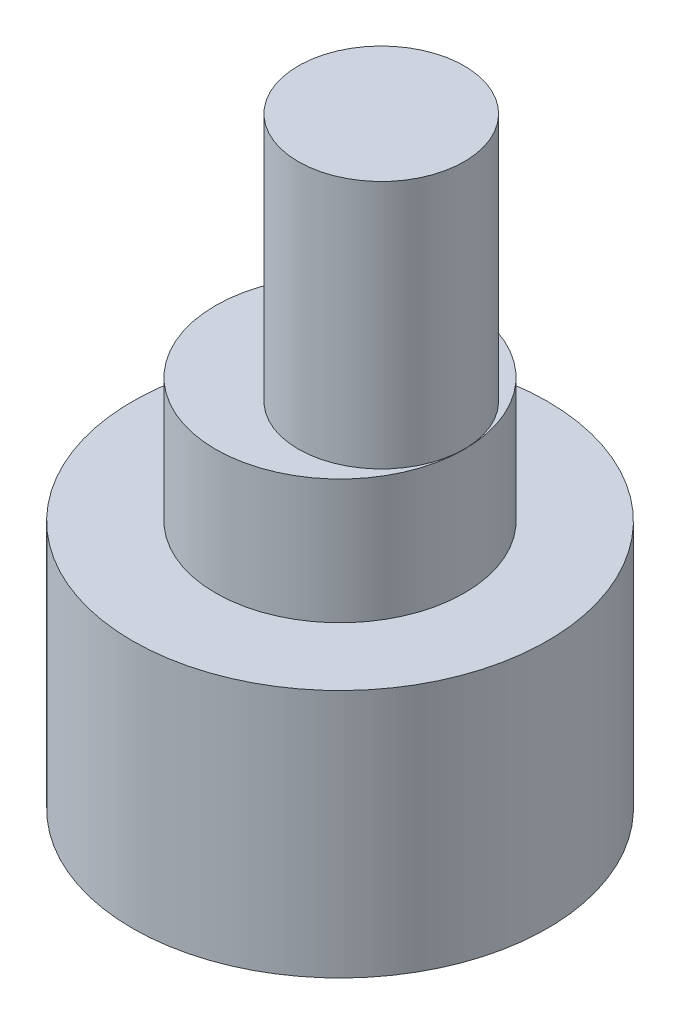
ISO-10303-21;
HEADER;
FILE_DESCRIPTION(('STEP AP214'),'2;1');
FILE_NAME('part.step','',(''),(''),'','','');
FILE_SCHEMA(('AUTOMOTIVE_DESIGN { 1 0 10303 214 1 1 1 1 }'));
ENDSEC;
DATA;
#1=APPLICATION_CONTEXT('core data for automotive mechanical design processes');
#2=APPLICATION_PROTOCOL_DEFINITION('international standard','automotive_design',2000,#1);
#3=PRODUCT_CONTEXT('',#1,'mechanical');
#4=PRODUCT('Part','Part','',(#3));
#5=PRODUCT_RELATED_PRODUCT_CATEGORY('part','',(#4));
#6=PRODUCT_DEFINITION_FORMATION('','',#4);
#7=PRODUCT_DEFINITION_CONTEXT('part definition',#1,'design');
#8=PRODUCT_DEFINITION('design','',#6,#7);
#9=PRODUCT_DEFINITION_SHAPE('','',#8);
#10=(LENGTH_UNIT() NAMED_UNIT(*) SI_UNIT(.MILLI.,.METRE.));
#11=(NAMED_UNIT(*) PLANE_ANGLE_UNIT() SI_UNIT($,.RADIAN.));
#12=(NAMED_UNIT(*) SI_UNIT($,.STERADIAN.) SOLID_ANGLE_UNIT());
#13=UNCERTAINTY_MEASURE_WITH_UNIT(LENGTH_MEASURE(1.E-05),#10,'distance_accuracy_value','');
#14=(GEOMETRIC_REPRESENTATION_CONTEXT(3) GLOBAL_UNCERTAINTY_ASSIGNED_CONTEXT((#13)) GLOBAL_UNIT_ASSIGNED_CONTEXT((#10,
#11,#12)) REPRESENTATION_CONTEXT('',''));
#15=CARTESIAN_POINT('',(0.,0.,0.));
#16=DIRECTION('',(0.,0.,1.));
#17=DIRECTION('',(1.,0.,0.));
#18=AXIS2_PLACEMENT_3D('',#15,#16,#17);
#19=CARTESIAN_POINT('',(0.,4.5,0.));
#20=DIRECTION('',(0.,-1.,0.));
#21=DIRECTION('',(0.,0.,-1.));
#22=AXIS2_PLACEMENT_3D('',#19,#20,#21);
#23=CYLINDRICAL_SURFACE('',#22,1.5);
#24=CARTESIAN_POINT('',(0.,4.5,0.));
#25=DIRECTION('',(0.,1.,0.));
#26=DIRECTION('',(0.,0.,1.));
#27=AXIS2_PLACEMENT_3D('',#24,#25,#26);
#28=CIRCLE('',#27,1.5);
#29=CARTESIAN_POINT('',(0.,4.5,1.5));
#30=VERTEX_POINT('',#29);
#31=EDGE_CURVE('E39',#30,#30,#28,.T.);
#32=ORIENTED_EDGE('',*,*,#31,.F.);
#33=EDGE_LOOP('',(#32));
#34=FACE_BOUND('',#33,.T.);
#35=CARTESIAN_POINT('',(0.,3.,0.));
#36=DIRECTION('',(0.,-1.,0.));
#37=DIRECTION('',(0.,0.,-1.));
#38=AXIS2_PLACEMENT_3D('',#35,#36,#37);
#39=CIRCLE('',#38,1.5);
#40=CARTESIAN_POINT('',(0.,3.,-1.5));
#41=VERTEX_POINT('',#40);
#42=EDGE_CURVE('E10',#41,#41,#39,.T.);
#43=ORIENTED_EDGE('',*,*,#42,.F.);
#44=EDGE_LOOP('',(#43));
#45=FACE_BOUND('',#44,.T.);
#46=ADVANCED_FACE('F33',(#34,#45),#23,.T.);
#47=CARTESIAN_POINT('',(0.,4.5,0.));
#48=DIRECTION('',(0.,1.,0.));
#49=DIRECTION('',(0.,0.,1.));
#50=AXIS2_PLACEMENT_3D('',#47,#48,#49);
#51=PLANE('',#50);
#52=ORIENTED_EDGE('',*,*,#31,.T.);
#53=EDGE_LOOP('',(#52));
#54=FACE_BOUND('',#53,.T.);
#55=CARTESIAN_POINT('',(0.49736,4.5,0.));
#56=DIRECTION('',(0.,1.,0.));
#57=DIRECTION('',(0.,0.,1.));
#58=AXIS2_PLACEMENT_3D('',#55,#56,#57);
#59=CIRCLE('',#58,1.);
#60=CARTESIAN_POINT('',(0.49736,4.5,1.));
#61=VERTEX_POINT('',#60);
#62=EDGE_CURVE('E47',#61,#61,#59,.T.);
#63=ORIENTED_EDGE('',*,*,#62,.F.);
#64=EDGE_LOOP('',(#63));
#65=FACE_BOUND('',#64,.T.);
#66=ADVANCED_FACE('F76',(#54,#65),#51,.T.);
#67=CARTESIAN_POINT('',(0.49736,7.5,0.));
#68=DIRECTION('',(0.,-1.,0.));
#69=DIRECTION('',(0.,0.,-1.));
#70=AXIS2_PLACEMENT_3D('',#67,#68,#69);
#71=CYLINDRICAL_SURFACE('',#70,1.);
#72=CARTESIAN_POINT('',(0.49736,7.5,0.));
#73=DIRECTION('',(0.,1.,0.));
#74=DIRECTION('',(0.,0.,1.));
#75=AXIS2_PLACEMENT_3D('',#72,#73,#74);
#76=CIRCLE('',#75,1.);
#77=CARTESIAN_POINT('',(0.49736,7.5,1.));
#78=VERTEX_POINT('',#77);
#79=EDGE_CURVE('E43',#78,#78,#76,.T.);
#80=ORIENTED_EDGE('',*,*,#79,.F.);
#81=EDGE_LOOP('',(#80));
#82=FACE_BOUND('',#81,.T.);
#83=ORIENTED_EDGE('',*,*,#62,.T.);
#84=EDGE_LOOP('',(#83));
#85=FACE_BOUND('',#84,.T.);
#86=ADVANCED_FACE('F72',(#82,#85),#71,.T.);
#87=CARTESIAN_POINT('',(0.49736,7.5,0.));
#88=DIRECTION('',(0.,1.,0.));
#89=DIRECTION('',(0.,0.,1.));
#90=AXIS2_PLACEMENT_3D('',#87,#88,#89);
#91=PLANE('',#90);
#92=ORIENTED_EDGE('',*,*,#79,.T.);
#93=EDGE_LOOP('',(#92));
#94=FACE_BOUND('',#93,.T.);
#95=ADVANCED_FACE('F64',(#94),#91,.T.);
#96=CARTESIAN_POINT('',(0.,3.,0.));
#97=DIRECTION('',(0.,-1.,0.));
#98=DIRECTION('',(0.,0.,-1.));
#99=AXIS2_PLACEMENT_3D('',#96,#97,#98);
#100=PLANE('',#99);
#101=CARTESIAN_POINT('',(0.,3.,0.));
#102=DIRECTION('',(0.,-1.,0.));
#103=DIRECTION('',(0.,0.,-1.));
#104=AXIS2_PLACEMENT_3D('',#101,#102,#103);
#105=CIRCLE('',#104,2.5);
#106=CARTESIAN_POINT('',(0.,3.,-2.5));
#107=VERTEX_POINT('',#106);
#108=EDGE_CURVE('E51',#107,#107,#105,.T.);
#109=ORIENTED_EDGE('',*,*,#108,.F.);
#110=EDGE_LOOP('',(#109));
#111=FACE_BOUND('',#110,.T.);
#112=ORIENTED_EDGE('',*,*,#42,.T.);
#113=EDGE_LOOP('',(#112));
#114=FACE_BOUND('',#113,.T.);
#115=ADVANCED_FACE('F62',(#111,#114),#100,.F.);
#116=CARTESIAN_POINT('',(0.,3.,0.));
#117=DIRECTION('',(0.,-1.,0.));
#118=DIRECTION('',(0.,0.,-1.));
#119=AXIS2_PLACEMENT_3D('',#116,#117,#118);
#120=CYLINDRICAL_SURFACE('',#119,2.5);
#121=ORIENTED_EDGE('',*,*,#108,.T.);
#122=EDGE_LOOP('',(#121));
#123=FACE_BOUND('',#122,.T.);
#124=CARTESIAN_POINT('',(0.,0.,0.));
#125=DIRECTION('',(0.,-1.,0.));
#126=DIRECTION('',(0.,0.,-1.));
#127=AXIS2_PLACEMENT_3D('',#124,#125,#126);
#128=CIRCLE('',#127,2.5);
#129=CARTESIAN_POINT('',(0.,0.,-2.5));
#130=VERTEX_POINT('',#129);
#131=EDGE_CURVE('E53',#130,#130,#128,.T.);
#132=ORIENTED_EDGE('',*,*,#131,.F.);
#133=EDGE_LOOP('',(#132));
#134=FACE_BOUND('',#133,.T.);
#135=ADVANCED_FACE('F59',(#123,#134),#120,.T.);
#136=CARTESIAN_POINT('',(0.,0.,0.));
#137=DIRECTION('',(0.,1.,0.));
#138=DIRECTION('',(0.,0.,1.));
#139=AXIS2_PLACEMENT_3D('',#136,#137,#138);
#140=PLANE('',#139);
#141=ORIENTED_EDGE('',*,*,#131,.T.);
#142=EDGE_LOOP('',(#141));
#143=FACE_BOUND('',#142,.T.);
#144=ADVANCED_FACE('F70',(#143),#140,.F.);
#145=CLOSED_SHELL('',(#46,#66,#86,#95,#115,#135,#144));
#146=MANIFOLD_SOLID_BREP('B2',#145);
#147=ADVANCED_BREP_SHAPE_REPRESENTATION('',(#18,#146),#14);
#148=SHAPE_DEFINITION_REPRESENTATION(#9,#147);
ENDSEC;
END-ISO-10303-21;
